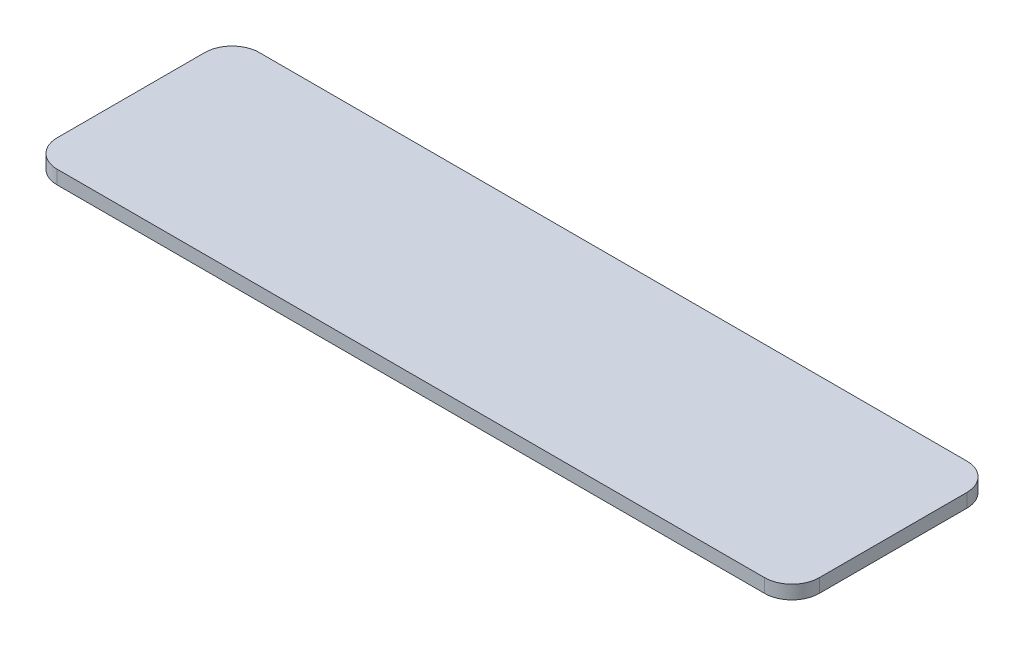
ISO-10303-21;
HEADER;
FILE_DESCRIPTION(('STEP AP214'),'2;1');
FILE_NAME('part.step','',(''),(''),'','','');
FILE_SCHEMA(('AUTOMOTIVE_DESIGN { 1 0 10303 214 1 1 1 1 }'));
ENDSEC;
DATA;
#1=APPLICATION_CONTEXT('core data for automotive mechanical design processes');
#2=APPLICATION_PROTOCOL_DEFINITION('international standard','automotive_design',2000,#1);
#3=PRODUCT_CONTEXT('',#1,'mechanical');
#4=PRODUCT('Part','Part','',(#3));
#5=PRODUCT_RELATED_PRODUCT_CATEGORY('part','',(#4));
#6=PRODUCT_DEFINITION_FORMATION('','',#4);
#7=PRODUCT_DEFINITION_CONTEXT('part definition',#1,'design');
#8=PRODUCT_DEFINITION('design','',#6,#7);
#9=PRODUCT_DEFINITION_SHAPE('','',#8);
#10=(LENGTH_UNIT() NAMED_UNIT(*) SI_UNIT(.MILLI.,.METRE.));
#11=(NAMED_UNIT(*) PLANE_ANGLE_UNIT() SI_UNIT($,.RADIAN.));
#12=(NAMED_UNIT(*) SI_UNIT($,.STERADIAN.) SOLID_ANGLE_UNIT());
#13=UNCERTAINTY_MEASURE_WITH_UNIT(LENGTH_MEASURE(1.E-05),#10,'distance_accuracy_value','');
#14=(GEOMETRIC_REPRESENTATION_CONTEXT(3) GLOBAL_UNCERTAINTY_ASSIGNED_CONTEXT((#13)) GLOBAL_UNIT_ASSIGNED_CONTEXT((#10,
#11,#12)) REPRESENTATION_CONTEXT('',''));
#15=CARTESIAN_POINT('',(0.,0.,0.));
#16=DIRECTION('',(0.,0.,1.));
#17=DIRECTION('',(1.,0.,0.));
#18=AXIS2_PLACEMENT_3D('',#15,#16,#17);
#19=CARTESIAN_POINT('',(27.9,-1.,-7.4));
#20=DIRECTION('',(1.,0.,0.));
#21=DIRECTION('',(0.,0.,-1.));
#22=AXIS2_PLACEMENT_3D('',#19,#20,#21);
#23=PLANE('',#22);
#24=DIRECTION('',(0.,0.,-1.));
#25=VECTOR('',#24,1.);
#26=CARTESIAN_POINT('',(27.9,0.,-7.4));
#27=LINE('',#26,#25);
#28=CARTESIAN_POINT('',(27.9,0.,5.4));
#29=VERTEX_POINT('',#28);
#30=CARTESIAN_POINT('',(27.9,0.,-5.4));
#31=VERTEX_POINT('',#30);
#32=EDGE_CURVE('E187',#29,#31,#27,.T.);
#33=ORIENTED_EDGE('',*,*,#32,.F.);
#34=DIRECTION('',(0.,1.,0.));
#35=VECTOR('',#34,1.);
#36=CARTESIAN_POINT('',(27.9,-1.,5.4));
#37=LINE('',#36,#35);
#38=CARTESIAN_POINT('',(27.9,-1.,5.4));
#39=VERTEX_POINT('',#38);
#40=EDGE_CURVE('E157',#29,#39,#37,.F.);
#41=ORIENTED_EDGE('',*,*,#40,.T.);
#42=DIRECTION('',(0.,0.,-1.));
#43=VECTOR('',#42,1.);
#44=CARTESIAN_POINT('',(27.9,-1.,-7.4));
#45=LINE('',#44,#43);
#46=CARTESIAN_POINT('',(27.9,-1.,-5.4));
#47=VERTEX_POINT('',#46);
#48=EDGE_CURVE('E131',#39,#47,#45,.T.);
#49=ORIENTED_EDGE('',*,*,#48,.T.);
#50=DIRECTION('',(0.,1.,0.));
#51=VECTOR('',#50,1.);
#52=CARTESIAN_POINT('',(27.9,-1.,-5.4));
#53=LINE('',#52,#51);
#54=EDGE_CURVE('E153',#47,#31,#53,.T.);
#55=ORIENTED_EDGE('',*,*,#54,.T.);
#56=EDGE_LOOP('',(#33,#41,#49,#55));
#57=FACE_BOUND('',#56,.T.);
#58=ADVANCED_FACE('F42',(#57),#23,.T.);
#59=CARTESIAN_POINT('',(-27.9,-1.,7.4));
#60=DIRECTION('',(0.,0.,1.));
#61=DIRECTION('',(1.,0.,0.));
#62=AXIS2_PLACEMENT_3D('',#59,#60,#61);
#63=PLANE('',#62);
#64=DIRECTION('',(1.,0.,0.));
#65=VECTOR('',#64,1.);
#66=CARTESIAN_POINT('',(-27.9,-1.,7.4));
#67=LINE('',#66,#65);
#68=CARTESIAN_POINT('',(-25.9,-1.,7.4));
#69=VERTEX_POINT('',#68);
#70=CARTESIAN_POINT('',(25.9,-1.,7.4));
#71=VERTEX_POINT('',#70);
#72=EDGE_CURVE('E136',#69,#71,#67,.T.);
#73=ORIENTED_EDGE('',*,*,#72,.T.);
#74=DIRECTION('',(0.,1.,0.));
#75=VECTOR('',#74,1.);
#76=CARTESIAN_POINT('',(25.9,-1.,7.4));
#77=LINE('',#76,#75);
#78=CARTESIAN_POINT('',(25.9,0.,7.4));
#79=VERTEX_POINT('',#78);
#80=EDGE_CURVE('E121',#71,#79,#77,.T.);
#81=ORIENTED_EDGE('',*,*,#80,.T.);
#82=DIRECTION('',(1.,0.,0.));
#83=VECTOR('',#82,1.);
#84=CARTESIAN_POINT('',(-27.9,0.,7.4));
#85=LINE('',#84,#83);
#86=CARTESIAN_POINT('',(-25.9,0.,7.4));
#87=VERTEX_POINT('',#86);
#88=EDGE_CURVE('E112',#87,#79,#85,.T.);
#89=ORIENTED_EDGE('',*,*,#88,.F.);
#90=DIRECTION('',(0.,1.,0.));
#91=VECTOR('',#90,1.);
#92=CARTESIAN_POINT('',(-25.9,-1.,7.4));
#93=LINE('',#92,#91);
#94=EDGE_CURVE('E127',#87,#69,#93,.F.);
#95=ORIENTED_EDGE('',*,*,#94,.T.);
#96=EDGE_LOOP('',(#73,#81,#89,#95));
#97=FACE_BOUND('',#96,.T.);
#98=ADVANCED_FACE('F126',(#97),#63,.T.);
#99=CARTESIAN_POINT('',(-27.9,-1.,-7.4));
#100=DIRECTION('',(-1.,0.,0.));
#101=DIRECTION('',(0.,0.,1.));
#102=AXIS2_PLACEMENT_3D('',#99,#100,#101);
#103=PLANE('',#102);
#104=DIRECTION('',(0.,0.,1.));
#105=VECTOR('',#104,1.);
#106=CARTESIAN_POINT('',(-27.9,0.,-7.4));
#107=LINE('',#106,#105);
#108=CARTESIAN_POINT('',(-27.9,0.,-5.4));
#109=VERTEX_POINT('',#108);
#110=CARTESIAN_POINT('',(-27.9,0.,5.4));
#111=VERTEX_POINT('',#110);
#112=EDGE_CURVE('E114',#109,#111,#107,.T.);
#113=ORIENTED_EDGE('',*,*,#112,.F.);
#114=DIRECTION('',(0.,1.,0.));
#115=VECTOR('',#114,1.);
#116=CARTESIAN_POINT('',(-27.9,-1.,-5.4));
#117=LINE('',#116,#115);
#118=CARTESIAN_POINT('',(-27.9,-1.,-5.4));
#119=VERTEX_POINT('',#118);
#120=EDGE_CURVE('E11',#109,#119,#117,.F.);
#121=ORIENTED_EDGE('',*,*,#120,.T.);
#122=DIRECTION('',(0.,0.,1.));
#123=VECTOR('',#122,1.);
#124=CARTESIAN_POINT('',(-27.9,-1.,-7.4));
#125=LINE('',#124,#123);
#126=CARTESIAN_POINT('',(-27.9,-1.,5.4));
#127=VERTEX_POINT('',#126);
#128=EDGE_CURVE('E141',#119,#127,#125,.T.);
#129=ORIENTED_EDGE('',*,*,#128,.T.);
#130=DIRECTION('',(0.,1.,0.));
#131=VECTOR('',#130,1.);
#132=CARTESIAN_POINT('',(-27.9,-1.,5.4));
#133=LINE('',#132,#131);
#134=EDGE_CURVE('E51',#127,#111,#133,.T.);
#135=ORIENTED_EDGE('',*,*,#134,.T.);
#136=EDGE_LOOP('',(#113,#121,#129,#135));
#137=FACE_BOUND('',#136,.T.);
#138=ADVANCED_FACE('F178',(#137),#103,.T.);
#139=CARTESIAN_POINT('',(-27.9,-1.,-7.4));
#140=DIRECTION('',(0.,0.,-1.));
#141=DIRECTION('',(-1.,0.,0.));
#142=AXIS2_PLACEMENT_3D('',#139,#140,#141);
#143=PLANE('',#142);
#144=DIRECTION('',(-1.,0.,0.));
#145=VECTOR('',#144,1.);
#146=CARTESIAN_POINT('',(-27.9,0.,-7.4));
#147=LINE('',#146,#145);
#148=CARTESIAN_POINT('',(25.9,0.,-7.4));
#149=VERTEX_POINT('',#148);
#150=CARTESIAN_POINT('',(-25.9,0.,-7.4));
#151=VERTEX_POINT('',#150);
#152=EDGE_CURVE('E191',#149,#151,#147,.T.);
#153=ORIENTED_EDGE('',*,*,#152,.F.);
#154=DIRECTION('',(0.,1.,0.));
#155=VECTOR('',#154,1.);
#156=CARTESIAN_POINT('',(25.9,-1.,-7.4));
#157=LINE('',#156,#155);
#158=CARTESIAN_POINT('',(25.9,-1.,-7.4));
#159=VERTEX_POINT('',#158);
#160=EDGE_CURVE('E65',#149,#159,#157,.F.);
#161=ORIENTED_EDGE('',*,*,#160,.T.);
#162=DIRECTION('',(-1.,0.,0.));
#163=VECTOR('',#162,1.);
#164=CARTESIAN_POINT('',(-27.9,-1.,-7.4));
#165=LINE('',#164,#163);
#166=CARTESIAN_POINT('',(-25.9,-1.,-7.4));
#167=VERTEX_POINT('',#166);
#168=EDGE_CURVE('E181',#159,#167,#165,.T.);
#169=ORIENTED_EDGE('',*,*,#168,.T.);
#170=DIRECTION('',(0.,1.,0.));
#171=VECTOR('',#170,1.);
#172=CARTESIAN_POINT('',(-25.9,-1.,-7.4));
#173=LINE('',#172,#171);
#174=EDGE_CURVE('E170',#167,#151,#173,.T.);
#175=ORIENTED_EDGE('',*,*,#174,.T.);
#176=EDGE_LOOP('',(#153,#161,#169,#175));
#177=FACE_BOUND('',#176,.T.);
#178=ADVANCED_FACE('F206',(#177),#143,.T.);
#179=CARTESIAN_POINT('',(0.,-1.,0.));
#180=DIRECTION('',(0.,1.,0.));
#181=DIRECTION('',(0.,0.,1.));
#182=AXIS2_PLACEMENT_3D('',#179,#180,#181);
#183=PLANE('',#182);
#184=ORIENTED_EDGE('',*,*,#48,.F.);
#185=CARTESIAN_POINT('',(25.9,-1.,5.4));
#186=DIRECTION('',(0.,1.,0.));
#187=DIRECTION('',(0.,0.,1.));
#188=AXIS2_PLACEMENT_3D('',#185,#186,#187);
#189=CIRCLE('',#188,2.);
#190=EDGE_CURVE('E167',#39,#71,#189,.F.);
#191=ORIENTED_EDGE('',*,*,#190,.T.);
#192=ORIENTED_EDGE('',*,*,#72,.F.);
#193=CARTESIAN_POINT('',(-25.9,-1.,5.4));
#194=DIRECTION('',(0.,1.,0.));
#195=DIRECTION('',(0.,0.,1.));
#196=AXIS2_PLACEMENT_3D('',#193,#194,#195);
#197=CIRCLE('',#196,2.);
#198=EDGE_CURVE('E134',#69,#127,#197,.F.);
#199=ORIENTED_EDGE('',*,*,#198,.T.);
#200=ORIENTED_EDGE('',*,*,#128,.F.);
#201=CARTESIAN_POINT('',(-25.9,-1.,-5.4));
#202=DIRECTION('',(0.,1.,0.));
#203=DIRECTION('',(0.,0.,1.));
#204=AXIS2_PLACEMENT_3D('',#201,#202,#203);
#205=CIRCLE('',#204,2.);
#206=EDGE_CURVE('E58',#119,#167,#205,.F.);
#207=ORIENTED_EDGE('',*,*,#206,.T.);
#208=ORIENTED_EDGE('',*,*,#168,.F.);
#209=CARTESIAN_POINT('',(25.9,-1.,-5.4));
#210=DIRECTION('',(0.,1.,0.));
#211=DIRECTION('',(0.,0.,1.));
#212=AXIS2_PLACEMENT_3D('',#209,#210,#211);
#213=CIRCLE('',#212,2.);
#214=EDGE_CURVE('E164',#159,#47,#213,.F.);
#215=ORIENTED_EDGE('',*,*,#214,.T.);
#216=EDGE_LOOP('',(#184,#191,#192,#199,#200,#207,#208,#215));
#217=FACE_BOUND('',#216,.T.);
#218=ADVANCED_FACE('F231',(#217),#183,.F.);
#219=CARTESIAN_POINT('',(0.,0.,0.));
#220=DIRECTION('',(0.,1.,0.));
#221=DIRECTION('',(0.,0.,1.));
#222=AXIS2_PLACEMENT_3D('',#219,#220,#221);
#223=PLANE('',#222);
#224=ORIENTED_EDGE('',*,*,#88,.T.);
#225=CARTESIAN_POINT('',(25.9,0.,5.4));
#226=DIRECTION('',(0.,1.,0.));
#227=DIRECTION('',(0.,0.,1.));
#228=AXIS2_PLACEMENT_3D('',#225,#226,#227);
#229=CIRCLE('',#228,2.);
#230=EDGE_CURVE('E150',#79,#29,#229,.T.);
#231=ORIENTED_EDGE('',*,*,#230,.T.);
#232=ORIENTED_EDGE('',*,*,#32,.T.);
#233=CARTESIAN_POINT('',(25.9,0.,-5.4));
#234=DIRECTION('',(0.,1.,0.));
#235=DIRECTION('',(0.,0.,1.));
#236=AXIS2_PLACEMENT_3D('',#233,#234,#235);
#237=CIRCLE('',#236,2.);
#238=EDGE_CURVE('E147',#31,#149,#237,.T.);
#239=ORIENTED_EDGE('',*,*,#238,.T.);
#240=ORIENTED_EDGE('',*,*,#152,.T.);
#241=CARTESIAN_POINT('',(-25.9,0.,-5.4));
#242=DIRECTION('',(0.,1.,0.));
#243=DIRECTION('',(0.,0.,1.));
#244=AXIS2_PLACEMENT_3D('',#241,#242,#243);
#245=CIRCLE('',#244,2.);
#246=EDGE_CURVE('E120',#151,#109,#245,.T.);
#247=ORIENTED_EDGE('',*,*,#246,.T.);
#248=ORIENTED_EDGE('',*,*,#112,.T.);
#249=CARTESIAN_POINT('',(-25.9,0.,5.4));
#250=DIRECTION('',(0.,1.,0.));
#251=DIRECTION('',(0.,0.,1.));
#252=AXIS2_PLACEMENT_3D('',#249,#250,#251);
#253=CIRCLE('',#252,2.);
#254=EDGE_CURVE('E109',#111,#87,#253,.T.);
#255=ORIENTED_EDGE('',*,*,#254,.T.);
#256=EDGE_LOOP('',(#224,#231,#232,#239,#240,#247,#248,#255));
#257=FACE_BOUND('',#256,.T.);
#258=ADVANCED_FACE('F111',(#257),#223,.T.);
#259=CARTESIAN_POINT('',(25.9,-1.,5.4));
#260=DIRECTION('',(0.,1.,0.));
#261=DIRECTION('',(0.,0.,1.));
#262=AXIS2_PLACEMENT_3D('',#259,#260,#261);
#263=CYLINDRICAL_SURFACE('',#262,2.);
#264=ORIENTED_EDGE('',*,*,#190,.F.);
#265=ORIENTED_EDGE('',*,*,#40,.F.);
#266=ORIENTED_EDGE('',*,*,#230,.F.);
#267=ORIENTED_EDGE('',*,*,#80,.F.);
#268=EDGE_LOOP('',(#264,#265,#266,#267));
#269=FACE_BOUND('',#268,.T.);
#270=ADVANCED_FACE('F215',(#269),#263,.T.);
#271=CARTESIAN_POINT('',(25.9,-1.,-5.4));
#272=DIRECTION('',(0.,1.,0.));
#273=DIRECTION('',(0.,0.,1.));
#274=AXIS2_PLACEMENT_3D('',#271,#272,#273);
#275=CYLINDRICAL_SURFACE('',#274,2.);
#276=ORIENTED_EDGE('',*,*,#214,.F.);
#277=ORIENTED_EDGE('',*,*,#160,.F.);
#278=ORIENTED_EDGE('',*,*,#238,.F.);
#279=ORIENTED_EDGE('',*,*,#54,.F.);
#280=EDGE_LOOP('',(#276,#277,#278,#279));
#281=FACE_BOUND('',#280,.T.);
#282=ADVANCED_FACE('F205',(#281),#275,.T.);
#283=CARTESIAN_POINT('',(-25.9,-1.,-5.4));
#284=DIRECTION('',(0.,1.,0.));
#285=DIRECTION('',(0.,0.,1.));
#286=AXIS2_PLACEMENT_3D('',#283,#284,#285);
#287=CYLINDRICAL_SURFACE('',#286,2.);
#288=ORIENTED_EDGE('',*,*,#206,.F.);
#289=ORIENTED_EDGE('',*,*,#120,.F.);
#290=ORIENTED_EDGE('',*,*,#246,.F.);
#291=ORIENTED_EDGE('',*,*,#174,.F.);
#292=EDGE_LOOP('',(#288,#289,#290,#291));
#293=FACE_BOUND('',#292,.T.);
#294=ADVANCED_FACE('F209',(#293),#287,.T.);
#295=CARTESIAN_POINT('',(-25.9,-1.,5.4));
#296=DIRECTION('',(0.,1.,0.));
#297=DIRECTION('',(0.,0.,1.));
#298=AXIS2_PLACEMENT_3D('',#295,#296,#297);
#299=CYLINDRICAL_SURFACE('',#298,2.);
#300=ORIENTED_EDGE('',*,*,#198,.F.);
#301=ORIENTED_EDGE('',*,*,#94,.F.);
#302=ORIENTED_EDGE('',*,*,#254,.F.);
#303=ORIENTED_EDGE('',*,*,#134,.F.);
#304=EDGE_LOOP('',(#300,#301,#302,#303));
#305=FACE_BOUND('',#304,.T.);
#306=ADVANCED_FACE('F44',(#305),#299,.T.);
#307=CLOSED_SHELL('',(#58,#98,#138,#178,#218,#258,#270,#282,#294,#306));
#308=MANIFOLD_SOLID_BREP('B2',#307);
#309=ADVANCED_BREP_SHAPE_REPRESENTATION('',(#18,#308),#14);
#310=SHAPE_DEFINITION_REPRESENTATION(#9,#309);
ENDSEC;
END-ISO-10303-21;
